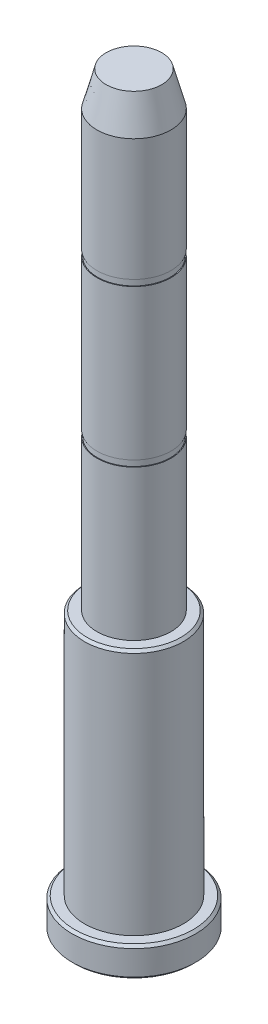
ISO-10303-21;
HEADER;
FILE_DESCRIPTION(('STEP AP214'),'2;1');
FILE_NAME('part.step','',(''),(''),'','','');
FILE_SCHEMA(('AUTOMOTIVE_DESIGN { 1 0 10303 214 1 1 1 1 }'));
ENDSEC;
DATA;
#1=APPLICATION_CONTEXT('core data for automotive mechanical design processes');
#2=APPLICATION_PROTOCOL_DEFINITION('international standard','automotive_design',2000,#1);
#3=PRODUCT_CONTEXT('',#1,'mechanical');
#4=PRODUCT('Part','Part','',(#3));
#5=PRODUCT_RELATED_PRODUCT_CATEGORY('part','',(#4));
#6=PRODUCT_DEFINITION_FORMATION('','',#4);
#7=PRODUCT_DEFINITION_CONTEXT('part definition',#1,'design');
#8=PRODUCT_DEFINITION('design','',#6,#7);
#9=PRODUCT_DEFINITION_SHAPE('','',#8);
#10=(LENGTH_UNIT() NAMED_UNIT(*) SI_UNIT(.MILLI.,.METRE.));
#11=(NAMED_UNIT(*) PLANE_ANGLE_UNIT() SI_UNIT($,.RADIAN.));
#12=(NAMED_UNIT(*) SI_UNIT($,.STERADIAN.) SOLID_ANGLE_UNIT());
#13=UNCERTAINTY_MEASURE_WITH_UNIT(LENGTH_MEASURE(1.E-05),#10,'distance_accuracy_value','');
#14=(GEOMETRIC_REPRESENTATION_CONTEXT(3) GLOBAL_UNCERTAINTY_ASSIGNED_CONTEXT((#13)) GLOBAL_UNIT_ASSIGNED_CONTEXT((#10,
#11,#12)) REPRESENTATION_CONTEXT('',''));
#15=CARTESIAN_POINT('',(0.,0.,0.));
#16=DIRECTION('',(0.,0.,1.));
#17=DIRECTION('',(1.,0.,0.));
#18=AXIS2_PLACEMENT_3D('',#15,#16,#17);
#19=CARTESIAN_POINT('',(0.,-6.,0.));
#20=DIRECTION('',(0.,1.,0.));
#21=DIRECTION('',(-1.,0.,0.));
#22=AXIS2_PLACEMENT_3D('',#19,#20,#21);
#23=PLANE('',#22);
#24=CARTESIAN_POINT('',(0.,-6.,0.));
#25=DIRECTION('',(0.,1.,0.));
#26=DIRECTION('',(-1.,0.,0.));
#27=AXIS2_PLACEMENT_3D('',#24,#25,#26);
#28=CIRCLE('',#27,12.);
#29=CARTESIAN_POINT('',(-12.,-6.,0.));
#30=VERTEX_POINT('',#29);
#31=EDGE_CURVE('E8',#30,#30,#28,.F.);
#32=ORIENTED_EDGE('',*,*,#31,.T.);
#33=EDGE_LOOP('',(#32));
#34=FACE_BOUND('',#33,.T.);
#35=ADVANCED_FACE('F13',(#34),#23,.F.);
#36=CARTESIAN_POINT('',(0.,145.,0.));
#37=DIRECTION('',(0.,1.,0.));
#38=DIRECTION('',(-1.,0.,0.));
#39=AXIS2_PLACEMENT_3D('',#36,#37,#38);
#40=CYLINDRICAL_SURFACE('',#39,12.5);
#41=CARTESIAN_POINT('',(0.,-0.499999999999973,0.));
#42=DIRECTION('',(0.,-1.,0.));
#43=DIRECTION('',(1.,0.,0.));
#44=AXIS2_PLACEMENT_3D('',#41,#42,#43);
#45=CIRCLE('',#44,12.5);
#46=CARTESIAN_POINT('',(12.5,-0.499999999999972,0.));
#47=VERTEX_POINT('',#46);
#48=EDGE_CURVE('E21',#47,#47,#45,.T.);
#49=ORIENTED_EDGE('',*,*,#48,.T.);
#50=EDGE_LOOP('',(#49));
#51=FACE_BOUND('',#50,.T.);
#52=CARTESIAN_POINT('',(0.,-5.5,0.));
#53=DIRECTION('',(0.,1.,0.));
#54=DIRECTION('',(-1.,0.,0.));
#55=AXIS2_PLACEMENT_3D('',#52,#53,#54);
#56=CIRCLE('',#55,12.5);
#57=CARTESIAN_POINT('',(-12.5,-5.5,0.));
#58=VERTEX_POINT('',#57);
#59=EDGE_CURVE('E28',#58,#58,#56,.T.);
#60=ORIENTED_EDGE('',*,*,#59,.T.);
#61=EDGE_LOOP('',(#60));
#62=FACE_BOUND('',#61,.T.);
#63=ADVANCED_FACE('F112',(#51,#62),#40,.T.);
#64=CARTESIAN_POINT('',(-12.5,0.,0.));
#65=DIRECTION('',(0.,-1.,0.));
#66=DIRECTION('',(1.,0.,0.));
#67=AXIS2_PLACEMENT_3D('',#64,#65,#66);
#68=PLANE('',#67);
#69=CARTESIAN_POINT('',(0.,0.,0.));
#70=DIRECTION('',(0.,-1.,0.));
#71=DIRECTION('',(1.,0.,0.));
#72=AXIS2_PLACEMENT_3D('',#69,#70,#71);
#73=CIRCLE('',#72,12.);
#74=CARTESIAN_POINT('',(12.,0.,0.));
#75=VERTEX_POINT('',#74);
#76=EDGE_CURVE('E35',#75,#75,#73,.F.);
#77=ORIENTED_EDGE('',*,*,#76,.T.);
#78=EDGE_LOOP('',(#77));
#79=FACE_BOUND('',#78,.T.);
#80=CARTESIAN_POINT('',(0.,0.,0.));
#81=DIRECTION('',(0.,1.,0.));
#82=DIRECTION('',(-1.,0.,0.));
#83=AXIS2_PLACEMENT_3D('',#80,#81,#82);
#84=CIRCLE('',#83,10.);
#85=CARTESIAN_POINT('',(-9.99999999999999,0.,0.));
#86=VERTEX_POINT('',#85);
#87=EDGE_CURVE('E48',#86,#86,#84,.T.);
#88=ORIENTED_EDGE('',*,*,#87,.F.);
#89=EDGE_LOOP('',(#88));
#90=FACE_BOUND('',#89,.T.);
#91=ADVANCED_FACE('F116',(#79,#90),#68,.F.);
#92=CARTESIAN_POINT('',(0.,145.,0.));
#93=DIRECTION('',(0.,1.,0.));
#94=DIRECTION('',(-1.,0.,0.));
#95=AXIS2_PLACEMENT_3D('',#92,#93,#94);
#96=CYLINDRICAL_SURFACE('',#95,10.);
#97=CARTESIAN_POINT('',(0.,49.5,0.));
#98=DIRECTION('',(0.,-1.,0.));
#99=DIRECTION('',(1.,0.,0.));
#100=AXIS2_PLACEMENT_3D('',#97,#98,#99);
#101=CIRCLE('',#100,10.);
#102=CARTESIAN_POINT('',(10.,49.5,0.));
#103=VERTEX_POINT('',#102);
#104=EDGE_CURVE('E40',#103,#103,#101,.T.);
#105=ORIENTED_EDGE('',*,*,#104,.T.);
#106=EDGE_LOOP('',(#105));
#107=FACE_BOUND('',#106,.T.);
#108=ORIENTED_EDGE('',*,*,#87,.T.);
#109=EDGE_LOOP('',(#108));
#110=FACE_BOUND('',#109,.T.);
#111=ADVANCED_FACE('F133',(#107,#110),#96,.T.);
#112=CARTESIAN_POINT('',(-10.,50.,0.));
#113=DIRECTION('',(0.,-1.,0.));
#114=DIRECTION('',(1.,0.,0.));
#115=AXIS2_PLACEMENT_3D('',#112,#113,#114);
#116=PLANE('',#115);
#117=CARTESIAN_POINT('',(0.,50.,0.));
#118=DIRECTION('',(0.,-1.,0.));
#119=DIRECTION('',(1.,0.,0.));
#120=AXIS2_PLACEMENT_3D('',#117,#118,#119);
#121=CIRCLE('',#120,9.5);
#122=CARTESIAN_POINT('',(9.5,50.,0.));
#123=VERTEX_POINT('',#122);
#124=EDGE_CURVE('E44',#123,#123,#121,.F.);
#125=ORIENTED_EDGE('',*,*,#124,.T.);
#126=EDGE_LOOP('',(#125));
#127=FACE_BOUND('',#126,.T.);
#128=CARTESIAN_POINT('',(0.,50.,0.));
#129=DIRECTION('',(0.,1.,0.));
#130=DIRECTION('',(-1.,0.,0.));
#131=AXIS2_PLACEMENT_3D('',#128,#129,#130);
#132=CIRCLE('',#131,7.5);
#133=CARTESIAN_POINT('',(-7.5,50.,0.));
#134=VERTEX_POINT('',#133);
#135=EDGE_CURVE('E52',#134,#134,#132,.T.);
#136=ORIENTED_EDGE('',*,*,#135,.F.);
#137=EDGE_LOOP('',(#136));
#138=FACE_BOUND('',#137,.T.);
#139=ADVANCED_FACE('F137',(#127,#138),#116,.F.);
#140=CARTESIAN_POINT('',(0.,145.,0.));
#141=DIRECTION('',(0.,1.,0.));
#142=DIRECTION('',(-1.,0.,0.));
#143=AXIS2_PLACEMENT_3D('',#140,#141,#142);
#144=CYLINDRICAL_SURFACE('',#143,7.5);
#145=CARTESIAN_POINT('',(0.,80.4166666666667,0.));
#146=DIRECTION('',(0.,1.,0.));
#147=DIRECTION('',(-1.,0.,0.));
#148=AXIS2_PLACEMENT_3D('',#145,#146,#147);
#149=CIRCLE('',#148,7.5);
#150=CARTESIAN_POINT('',(-7.5,80.4166666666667,0.));
#151=VERTEX_POINT('',#150);
#152=EDGE_CURVE('E56',#151,#151,#149,.T.);
#153=ORIENTED_EDGE('',*,*,#152,.F.);
#154=EDGE_LOOP('',(#153));
#155=FACE_BOUND('',#154,.T.);
#156=ORIENTED_EDGE('',*,*,#135,.T.);
#157=EDGE_LOOP('',(#156));
#158=FACE_BOUND('',#157,.T.);
#159=ADVANCED_FACE('F142',(#155,#158),#144,.T.);
#160=CARTESIAN_POINT('',(-7.5,80.4166666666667,0.));
#161=DIRECTION('',(0.,-1.,0.));
#162=DIRECTION('',(1.,0.,0.));
#163=AXIS2_PLACEMENT_3D('',#160,#161,#162);
#164=PLANE('',#163);
#165=CARTESIAN_POINT('',(0.,80.4166666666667,0.));
#166=DIRECTION('',(0.,1.,0.));
#167=DIRECTION('',(-1.,0.,0.));
#168=AXIS2_PLACEMENT_3D('',#165,#166,#167);
#169=CIRCLE('',#168,7.35);
#170=CARTESIAN_POINT('',(-7.35,80.4166666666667,0.));
#171=VERTEX_POINT('',#170);
#172=EDGE_CURVE('E60',#171,#171,#169,.T.);
#173=ORIENTED_EDGE('',*,*,#172,.F.);
#174=EDGE_LOOP('',(#173));
#175=FACE_BOUND('',#174,.T.);
#176=ORIENTED_EDGE('',*,*,#152,.T.);
#177=EDGE_LOOP('',(#176));
#178=FACE_BOUND('',#177,.T.);
#179=ADVANCED_FACE('F148',(#175,#178),#164,.F.);
#180=CARTESIAN_POINT('',(0.,145.,0.));
#181=DIRECTION('',(0.,1.,0.));
#182=DIRECTION('',(-1.,0.,0.));
#183=AXIS2_PLACEMENT_3D('',#180,#181,#182);
#184=CYLINDRICAL_SURFACE('',#183,7.35);
#185=CARTESIAN_POINT('',(0.,81.6666666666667,0.));
#186=DIRECTION('',(0.,1.,0.));
#187=DIRECTION('',(-1.,0.,0.));
#188=AXIS2_PLACEMENT_3D('',#185,#186,#187);
#189=CIRCLE('',#188,7.35);
#190=CARTESIAN_POINT('',(-7.35,81.6666666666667,0.));
#191=VERTEX_POINT('',#190);
#192=EDGE_CURVE('E64',#191,#191,#189,.T.);
#193=ORIENTED_EDGE('',*,*,#192,.F.);
#194=EDGE_LOOP('',(#193));
#195=FACE_BOUND('',#194,.T.);
#196=ORIENTED_EDGE('',*,*,#172,.T.);
#197=EDGE_LOOP('',(#196));
#198=FACE_BOUND('',#197,.T.);
#199=ADVANCED_FACE('F152',(#195,#198),#184,.T.);
#200=CARTESIAN_POINT('',(-7.35,81.6666666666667,0.));
#201=DIRECTION('',(0.,1.,0.));
#202=DIRECTION('',(-1.,0.,0.));
#203=AXIS2_PLACEMENT_3D('',#200,#201,#202);
#204=PLANE('',#203);
#205=CARTESIAN_POINT('',(0.,81.6666666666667,0.));
#206=DIRECTION('',(0.,1.,0.));
#207=DIRECTION('',(-1.,0.,0.));
#208=AXIS2_PLACEMENT_3D('',#205,#206,#207);
#209=CIRCLE('',#208,7.5);
#210=CARTESIAN_POINT('',(-7.5,81.6666666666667,0.));
#211=VERTEX_POINT('',#210);
#212=EDGE_CURVE('E67',#211,#211,#209,.T.);
#213=ORIENTED_EDGE('',*,*,#212,.F.);
#214=EDGE_LOOP('',(#213));
#215=FACE_BOUND('',#214,.T.);
#216=ORIENTED_EDGE('',*,*,#192,.T.);
#217=EDGE_LOOP('',(#216));
#218=FACE_BOUND('',#217,.T.);
#219=ADVANCED_FACE('F156',(#215,#218),#204,.F.);
#220=CARTESIAN_POINT('',(0.,145.,0.));
#221=DIRECTION('',(0.,1.,0.));
#222=DIRECTION('',(-1.,0.,0.));
#223=AXIS2_PLACEMENT_3D('',#220,#221,#222);
#224=CYLINDRICAL_SURFACE('',#223,7.5);
#225=CARTESIAN_POINT('',(0.,112.083333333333,0.));
#226=DIRECTION('',(0.,1.,0.));
#227=DIRECTION('',(-1.,0.,0.));
#228=AXIS2_PLACEMENT_3D('',#225,#226,#227);
#229=CIRCLE('',#228,7.5);
#230=CARTESIAN_POINT('',(-7.5,112.083333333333,0.));
#231=VERTEX_POINT('',#230);
#232=EDGE_CURVE('E71',#231,#231,#229,.T.);
#233=ORIENTED_EDGE('',*,*,#232,.F.);
#234=EDGE_LOOP('',(#233));
#235=FACE_BOUND('',#234,.T.);
#236=ORIENTED_EDGE('',*,*,#212,.T.);
#237=EDGE_LOOP('',(#236));
#238=FACE_BOUND('',#237,.T.);
#239=ADVANCED_FACE('F160',(#235,#238),#224,.T.);
#240=CARTESIAN_POINT('',(-7.5,112.083333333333,0.));
#241=DIRECTION('',(0.,-1.,0.));
#242=DIRECTION('',(1.,0.,0.));
#243=AXIS2_PLACEMENT_3D('',#240,#241,#242);
#244=PLANE('',#243);
#245=CARTESIAN_POINT('',(0.,112.083333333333,0.));
#246=DIRECTION('',(0.,1.,0.));
#247=DIRECTION('',(-1.,0.,0.));
#248=AXIS2_PLACEMENT_3D('',#245,#246,#247);
#249=CIRCLE('',#248,7.35);
#250=CARTESIAN_POINT('',(-7.35,112.083333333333,0.));
#251=VERTEX_POINT('',#250);
#252=EDGE_CURVE('E75',#251,#251,#249,.T.);
#253=ORIENTED_EDGE('',*,*,#252,.F.);
#254=EDGE_LOOP('',(#253));
#255=FACE_BOUND('',#254,.T.);
#256=ORIENTED_EDGE('',*,*,#232,.T.);
#257=EDGE_LOOP('',(#256));
#258=FACE_BOUND('',#257,.T.);
#259=ADVANCED_FACE('F164',(#255,#258),#244,.F.);
#260=CARTESIAN_POINT('',(0.,145.,0.));
#261=DIRECTION('',(0.,1.,0.));
#262=DIRECTION('',(-1.,0.,0.));
#263=AXIS2_PLACEMENT_3D('',#260,#261,#262);
#264=CYLINDRICAL_SURFACE('',#263,7.35);
#265=CARTESIAN_POINT('',(0.,113.333333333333,0.));
#266=DIRECTION('',(0.,1.,0.));
#267=DIRECTION('',(-1.,0.,0.));
#268=AXIS2_PLACEMENT_3D('',#265,#266,#267);
#269=CIRCLE('',#268,7.35);
#270=CARTESIAN_POINT('',(-7.35,113.333333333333,0.));
#271=VERTEX_POINT('',#270);
#272=EDGE_CURVE('E79',#271,#271,#269,.T.);
#273=ORIENTED_EDGE('',*,*,#272,.F.);
#274=EDGE_LOOP('',(#273));
#275=FACE_BOUND('',#274,.T.);
#276=ORIENTED_EDGE('',*,*,#252,.T.);
#277=EDGE_LOOP('',(#276));
#278=FACE_BOUND('',#277,.T.);
#279=ADVANCED_FACE('F168',(#275,#278),#264,.T.);
#280=CARTESIAN_POINT('',(-7.35,113.333333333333,0.));
#281=DIRECTION('',(0.,1.,0.));
#282=DIRECTION('',(-1.,0.,0.));
#283=AXIS2_PLACEMENT_3D('',#280,#281,#282);
#284=PLANE('',#283);
#285=CARTESIAN_POINT('',(0.,113.333333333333,0.));
#286=DIRECTION('',(0.,1.,0.));
#287=DIRECTION('',(-1.,0.,0.));
#288=AXIS2_PLACEMENT_3D('',#285,#286,#287);
#289=CIRCLE('',#288,7.5);
#290=CARTESIAN_POINT('',(-7.5,113.333333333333,0.));
#291=VERTEX_POINT('',#290);
#292=EDGE_CURVE('E83',#291,#291,#289,.T.);
#293=ORIENTED_EDGE('',*,*,#292,.F.);
#294=EDGE_LOOP('',(#293));
#295=FACE_BOUND('',#294,.T.);
#296=ORIENTED_EDGE('',*,*,#272,.T.);
#297=EDGE_LOOP('',(#296));
#298=FACE_BOUND('',#297,.T.);
#299=ADVANCED_FACE('F108',(#295,#298),#284,.F.);
#300=CARTESIAN_POINT('',(0.,145.,0.));
#301=DIRECTION('',(0.,1.,0.));
#302=DIRECTION('',(-1.,0.,0.));
#303=AXIS2_PLACEMENT_3D('',#300,#301,#302);
#304=CYLINDRICAL_SURFACE('',#303,7.5);
#305=CARTESIAN_POINT('',(0.,138.,0.));
#306=DIRECTION('',(0.,1.,0.));
#307=DIRECTION('',(-1.,0.,0.));
#308=AXIS2_PLACEMENT_3D('',#305,#306,#307);
#309=CIRCLE('',#308,7.5);
#310=CARTESIAN_POINT('',(-7.5,138.,0.));
#311=VERTEX_POINT('',#310);
#312=EDGE_CURVE('E87',#311,#311,#309,.T.);
#313=ORIENTED_EDGE('',*,*,#312,.F.);
#314=EDGE_LOOP('',(#313));
#315=FACE_BOUND('',#314,.T.);
#316=ORIENTED_EDGE('',*,*,#292,.T.);
#317=EDGE_LOOP('',(#316));
#318=FACE_BOUND('',#317,.T.);
#319=ADVANCED_FACE('F99',(#315,#318),#304,.T.);
#320=CARTESIAN_POINT('',(0.,145.,0.));
#321=DIRECTION('',(0.,-1.,0.));
#322=DIRECTION('',(1.,0.,0.));
#323=AXIS2_PLACEMENT_3D('',#320,#321,#322);
#324=CONICAL_SURFACE('',#323,5.62435565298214,0.261799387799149);
#325=ORIENTED_EDGE('',*,*,#312,.T.);
#326=EDGE_LOOP('',(#325));
#327=FACE_BOUND('',#326,.T.);
#328=CARTESIAN_POINT('',(0.,145.,0.));
#329=DIRECTION('',(0.,1.,0.));
#330=DIRECTION('',(-1.,0.,0.));
#331=AXIS2_PLACEMENT_3D('',#328,#329,#330);
#332=CIRCLE('',#331,5.62435565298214);
#333=CARTESIAN_POINT('',(-5.62435565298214,145.,0.));
#334=VERTEX_POINT('',#333);
#335=EDGE_CURVE('E90',#334,#334,#332,.T.);
#336=ORIENTED_EDGE('',*,*,#335,.F.);
#337=EDGE_LOOP('',(#336));
#338=FACE_BOUND('',#337,.T.);
#339=ADVANCED_FACE('F97',(#327,#338),#324,.T.);
#340=CARTESIAN_POINT('',(-5.62435565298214,145.,0.));
#341=DIRECTION('',(0.,-1.,0.));
#342=DIRECTION('',(1.,0.,0.));
#343=AXIS2_PLACEMENT_3D('',#340,#341,#342);
#344=PLANE('',#343);
#345=ORIENTED_EDGE('',*,*,#335,.T.);
#346=EDGE_LOOP('',(#345));
#347=FACE_BOUND('',#346,.T.);
#348=ADVANCED_FACE('F95',(#347),#344,.F.);
#349=CARTESIAN_POINT('',(0.,50.,0.));
#350=DIRECTION('',(0.,-1.,0.));
#351=DIRECTION('',(1.,0.,0.));
#352=AXIS2_PLACEMENT_3D('',#349,#350,#351);
#353=CONICAL_SURFACE('',#352,9.5,0.785398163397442);
#354=ORIENTED_EDGE('',*,*,#104,.F.);
#355=EDGE_LOOP('',(#354));
#356=FACE_BOUND('',#355,.T.);
#357=ORIENTED_EDGE('',*,*,#124,.F.);
#358=EDGE_LOOP('',(#357));
#359=FACE_BOUND('',#358,.T.);
#360=ADVANCED_FACE('F106',(#356,#359),#353,.T.);
#361=CARTESIAN_POINT('',(0.,0.,0.));
#362=DIRECTION('',(0.,-1.,0.));
#363=DIRECTION('',(1.,0.,0.));
#364=AXIS2_PLACEMENT_3D('',#361,#362,#363);
#365=CONICAL_SURFACE('',#364,12.,0.785398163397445);
#366=ORIENTED_EDGE('',*,*,#48,.F.);
#367=EDGE_LOOP('',(#366));
#368=FACE_BOUND('',#367,.T.);
#369=ORIENTED_EDGE('',*,*,#76,.F.);
#370=EDGE_LOOP('',(#369));
#371=FACE_BOUND('',#370,.T.);
#372=ADVANCED_FACE('F121',(#368,#371),#365,.T.);
#373=CARTESIAN_POINT('',(0.,-5.5,0.));
#374=DIRECTION('',(0.,1.,0.));
#375=DIRECTION('',(-1.,0.,0.));
#376=AXIS2_PLACEMENT_3D('',#373,#374,#375);
#377=CONICAL_SURFACE('',#376,12.5,0.785398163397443);
#378=ORIENTED_EDGE('',*,*,#31,.F.);
#379=EDGE_LOOP('',(#378));
#380=FACE_BOUND('',#379,.T.);
#381=ORIENTED_EDGE('',*,*,#59,.F.);
#382=EDGE_LOOP('',(#381));
#383=FACE_BOUND('',#382,.T.);
#384=ADVANCED_FACE('F15',(#380,#383),#377,.T.);
#385=CLOSED_SHELL('',(#35,#63,#91,#111,#139,#159,#179,#199,#219,#239,#259,#279,#299,#319,#339,
#348,#360,#372,#384));
#386=MANIFOLD_SOLID_BREP('B1',#385);
#387=ADVANCED_BREP_SHAPE_REPRESENTATION('',(#18,#386),#14);
#388=SHAPE_DEFINITION_REPRESENTATION(#9,#387);
ENDSEC;
END-ISO-10303-21;
